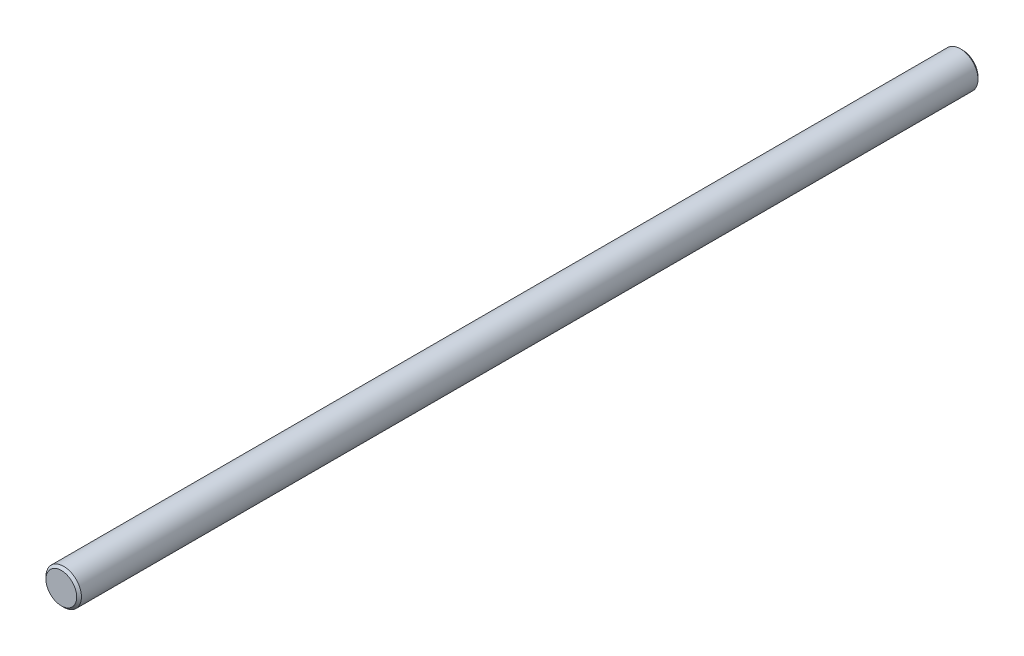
ISO-10303-21;
HEADER;
FILE_DESCRIPTION(('STEP AP214'),'2;1');
FILE_NAME('part.step','',(''),(''),'','','');
FILE_SCHEMA(('AUTOMOTIVE_DESIGN { 1 0 10303 214 1 1 1 1 }'));
ENDSEC;
DATA;
#1=APPLICATION_CONTEXT('core data for automotive mechanical design processes');
#2=APPLICATION_PROTOCOL_DEFINITION('international standard','automotive_design',2000,#1);
#3=PRODUCT_CONTEXT('',#1,'mechanical');
#4=PRODUCT('Part','Part','',(#3));
#5=PRODUCT_RELATED_PRODUCT_CATEGORY('part','',(#4));
#6=PRODUCT_DEFINITION_FORMATION('','',#4);
#7=PRODUCT_DEFINITION_CONTEXT('part definition',#1,'design');
#8=PRODUCT_DEFINITION('design','',#6,#7);
#9=PRODUCT_DEFINITION_SHAPE('','',#8);
#10=(LENGTH_UNIT() NAMED_UNIT(*) SI_UNIT(.MILLI.,.METRE.));
#11=(NAMED_UNIT(*) PLANE_ANGLE_UNIT() SI_UNIT($,.RADIAN.));
#12=(NAMED_UNIT(*) SI_UNIT($,.STERADIAN.) SOLID_ANGLE_UNIT());
#13=UNCERTAINTY_MEASURE_WITH_UNIT(LENGTH_MEASURE(1.E-05),#10,'distance_accuracy_value','');
#14=(GEOMETRIC_REPRESENTATION_CONTEXT(3) GLOBAL_UNCERTAINTY_ASSIGNED_CONTEXT((#13)) GLOBAL_UNIT_ASSIGNED_CONTEXT((#10,
#11,#12)) REPRESENTATION_CONTEXT('',''));
#15=CARTESIAN_POINT('',(0.,0.,0.));
#16=DIRECTION('',(0.,0.,1.));
#17=DIRECTION('',(1.,0.,0.));
#18=AXIS2_PLACEMENT_3D('',#15,#16,#17);
#19=CARTESIAN_POINT('',(0.,0.,305.));
#20=DIRECTION('',(0.,0.,-1.));
#21=DIRECTION('',(-1.,0.,0.));
#22=AXIS2_PLACEMENT_3D('',#19,#20,#21);
#23=CYLINDRICAL_SURFACE('',#22,6.);
#24=CARTESIAN_POINT('',(0.,0.,0.800000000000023));
#25=DIRECTION('',(0.,0.,1.));
#26=DIRECTION('',(1.,0.,0.));
#27=AXIS2_PLACEMENT_3D('',#24,#25,#26);
#28=CIRCLE('',#27,6.);
#29=CARTESIAN_POINT('',(6.,0.,0.800000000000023));
#30=VERTEX_POINT('',#29);
#31=EDGE_CURVE('E356',#30,#30,#28,.T.);
#32=ORIENTED_EDGE('',*,*,#31,.T.);
#33=EDGE_LOOP('',(#32));
#34=FACE_BOUND('',#33,.T.);
#35=CARTESIAN_POINT('',(0.,0.,304.2));
#36=DIRECTION('',(0.,0.,1.));
#37=DIRECTION('',(1.,0.,0.));
#38=AXIS2_PLACEMENT_3D('',#35,#36,#37);
#39=CIRCLE('',#38,6.);
#40=CARTESIAN_POINT('',(6.,0.,304.2));
#41=VERTEX_POINT('',#40);
#42=EDGE_CURVE('E360',#41,#41,#39,.F.);
#43=ORIENTED_EDGE('',*,*,#42,.T.);
#44=EDGE_LOOP('',(#43));
#45=FACE_BOUND('',#44,.T.);
#46=ADVANCED_FACE('F346',(#34,#45),#23,.T.);
#47=CARTESIAN_POINT('',(0.,0.,305.));
#48=DIRECTION('',(0.,0.,1.));
#49=DIRECTION('',(1.,0.,0.));
#50=AXIS2_PLACEMENT_3D('',#47,#48,#49);
#51=PLANE('',#50);
#52=CARTESIAN_POINT('',(0.,0.,305.));
#53=DIRECTION('',(0.,0.,1.));
#54=DIRECTION('',(1.,0.,0.));
#55=AXIS2_PLACEMENT_3D('',#52,#53,#54);
#56=CIRCLE('',#55,5.19999999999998);
#57=CARTESIAN_POINT('',(5.19999999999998,0.,305.));
#58=VERTEX_POINT('',#57);
#59=EDGE_CURVE('E10',#58,#58,#56,.T.);
#60=ORIENTED_EDGE('',*,*,#59,.T.);
#61=EDGE_LOOP('',(#60));
#62=FACE_BOUND('',#61,.T.);
#63=ADVANCED_FACE('F379',(#62),#51,.T.);
#64=CARTESIAN_POINT('',(0.,0.,0.));
#65=DIRECTION('',(0.,0.,1.));
#66=DIRECTION('',(1.,0.,0.));
#67=AXIS2_PLACEMENT_3D('',#64,#65,#66);
#68=PLANE('',#67);
#69=CARTESIAN_POINT('',(0.,0.,0.));
#70=DIRECTION('',(0.,0.,1.));
#71=DIRECTION('',(1.,0.,0.));
#72=AXIS2_PLACEMENT_3D('',#69,#70,#71);
#73=CIRCLE('',#72,5.19999999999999);
#74=CARTESIAN_POINT('',(5.19999999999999,0.,0.));
#75=VERTEX_POINT('',#74);
#76=EDGE_CURVE('E352',#75,#75,#73,.F.);
#77=ORIENTED_EDGE('',*,*,#76,.T.);
#78=EDGE_LOOP('',(#77));
#79=FACE_BOUND('',#78,.T.);
#80=ADVANCED_FACE('F375',(#79),#68,.F.);
#81=CARTESIAN_POINT('',(0.,0.,0.800000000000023));
#82=DIRECTION('',(0.,0.,1.));
#83=DIRECTION('',(1.,0.,0.));
#84=AXIS2_PLACEMENT_3D('',#81,#82,#83);
#85=CONICAL_SURFACE('',#84,6.,0.785398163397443);
#86=ORIENTED_EDGE('',*,*,#76,.F.);
#87=EDGE_LOOP('',(#86));
#88=FACE_BOUND('',#87,.T.);
#89=ORIENTED_EDGE('',*,*,#31,.F.);
#90=EDGE_LOOP('',(#89));
#91=FACE_BOUND('',#90,.T.);
#92=ADVANCED_FACE('F370',(#88,#91),#85,.T.);
#93=CARTESIAN_POINT('',(0.,0.,305.));
#94=DIRECTION('',(0.,0.,-1.));
#95=DIRECTION('',(-1.,0.,0.));
#96=AXIS2_PLACEMENT_3D('',#93,#94,#95);
#97=CONICAL_SURFACE('',#96,5.19999999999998,0.785398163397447);
#98=ORIENTED_EDGE('',*,*,#42,.F.);
#99=EDGE_LOOP('',(#98));
#100=FACE_BOUND('',#99,.T.);
#101=ORIENTED_EDGE('',*,*,#59,.F.);
#102=EDGE_LOOP('',(#101));
#103=FACE_BOUND('',#102,.T.);
#104=ADVANCED_FACE('F367',(#100,#103),#97,.T.);
#105=CLOSED_SHELL('',(#46,#63,#80,#92,#104));
#106=MANIFOLD_SOLID_BREP('B2',#105);
#107=ADVANCED_BREP_SHAPE_REPRESENTATION('',(#18,#106),#14);
#108=SHAPE_DEFINITION_REPRESENTATION(#9,#107);
ENDSEC;
END-ISO-10303-21;
